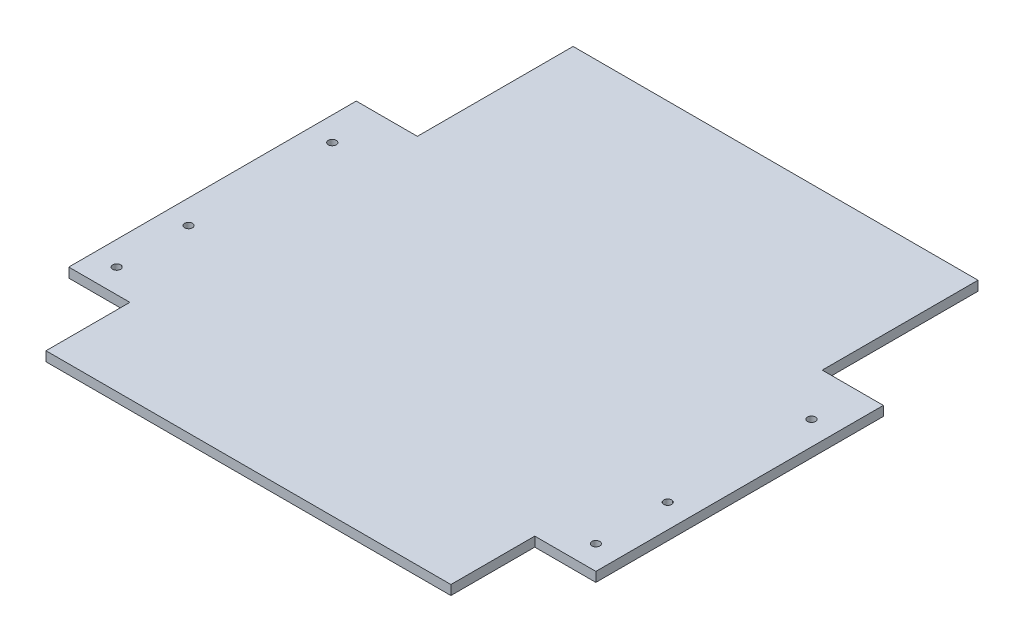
ISO-10303-21;
HEADER;
FILE_DESCRIPTION(('STEP AP214'),'2;1');
FILE_NAME('part.step','',(''),(''),'','','');
FILE_SCHEMA(('AUTOMOTIVE_DESIGN { 1 0 10303 214 1 1 1 1 }'));
ENDSEC;
DATA;
#1=APPLICATION_CONTEXT('core data for automotive mechanical design processes');
#2=APPLICATION_PROTOCOL_DEFINITION('international standard','automotive_design',2000,#1);
#3=PRODUCT_CONTEXT('',#1,'mechanical');
#4=PRODUCT('Part','Part','',(#3));
#5=PRODUCT_RELATED_PRODUCT_CATEGORY('part','',(#4));
#6=PRODUCT_DEFINITION_FORMATION('','',#4);
#7=PRODUCT_DEFINITION_CONTEXT('part definition',#1,'design');
#8=PRODUCT_DEFINITION('design','',#6,#7);
#9=PRODUCT_DEFINITION_SHAPE('','',#8);
#10=(LENGTH_UNIT() NAMED_UNIT(*) SI_UNIT(.MILLI.,.METRE.));
#11=(NAMED_UNIT(*) PLANE_ANGLE_UNIT() SI_UNIT($,.RADIAN.));
#12=(NAMED_UNIT(*) SI_UNIT($,.STERADIAN.) SOLID_ANGLE_UNIT());
#13=UNCERTAINTY_MEASURE_WITH_UNIT(LENGTH_MEASURE(1.E-05),#10,'distance_accuracy_value','');
#14=(GEOMETRIC_REPRESENTATION_CONTEXT(3) GLOBAL_UNCERTAINTY_ASSIGNED_CONTEXT((#13)) GLOBAL_UNIT_ASSIGNED_CONTEXT((#10,
#11,#12)) REPRESENTATION_CONTEXT('',''));
#15=CARTESIAN_POINT('',(0.,0.,0.));
#16=DIRECTION('',(0.,0.,1.));
#17=DIRECTION('',(1.,0.,0.));
#18=AXIS2_PLACEMENT_3D('',#15,#16,#17);
#19=CARTESIAN_POINT('',(84.5,-16.,0.));
#20=DIRECTION('',(-1.,0.,0.));
#21=DIRECTION('',(0.,1.,0.));
#22=AXIS2_PLACEMENT_3D('',#19,#20,#21);
#23=PLANE('',#22);
#24=DIRECTION('',(0.,0.,-1.));
#25=VECTOR('',#24,1.);
#26=CARTESIAN_POINT('',(84.5,0.,0.));
#27=LINE('',#26,#25);
#28=CARTESIAN_POINT('',(84.5,0.,-45.));
#29=VERTEX_POINT('',#28);
#30=CARTESIAN_POINT('',(84.5,0.,-110.));
#31=VERTEX_POINT('',#30);
#32=EDGE_CURVE('E234',#29,#31,#27,.T.);
#33=ORIENTED_EDGE('',*,*,#32,.T.);
#34=DIRECTION('',(0.,-1.,0.));
#35=VECTOR('',#34,1.);
#36=CARTESIAN_POINT('',(84.5,4.,-110.));
#37=LINE('',#36,#35);
#38=CARTESIAN_POINT('',(84.5,4.,-110.));
#39=VERTEX_POINT('',#38);
#40=EDGE_CURVE('E170',#39,#31,#37,.T.);
#41=ORIENTED_EDGE('',*,*,#40,.F.);
#42=DIRECTION('',(0.,0.,1.));
#43=VECTOR('',#42,1.);
#44=CARTESIAN_POINT('',(84.5,4.,0.));
#45=LINE('',#44,#43);
#46=CARTESIAN_POINT('',(84.5,4.,-45.));
#47=VERTEX_POINT('',#46);
#48=EDGE_CURVE('E212',#39,#47,#45,.T.);
#49=ORIENTED_EDGE('',*,*,#48,.T.);
#50=DIRECTION('',(0.,1.,0.));
#51=VECTOR('',#50,1.);
#52=CARTESIAN_POINT('',(84.5,-16.,-45.));
#53=LINE('',#52,#51);
#54=EDGE_CURVE('E10',#29,#47,#53,.T.);
#55=ORIENTED_EDGE('',*,*,#54,.F.);
#56=EDGE_LOOP('',(#33,#41,#49,#55));
#57=FACE_BOUND('',#56,.T.);
#58=ADVANCED_FACE('F16',(#57),#23,.F.);
#59=CARTESIAN_POINT('',(0.,-16.,-45.));
#60=DIRECTION('',(0.,0.,-1.));
#61=DIRECTION('',(0.,-1.,0.));
#62=AXIS2_PLACEMENT_3D('',#59,#60,#61);
#63=PLANE('',#62);
#64=ORIENTED_EDGE('',*,*,#54,.T.);
#65=DIRECTION('',(-1.,0.,0.));
#66=VECTOR('',#65,1.);
#67=CARTESIAN_POINT('',(0.,4.,-45.));
#68=LINE('',#67,#66);
#69=CARTESIAN_POINT('',(110.,4.,-45.));
#70=VERTEX_POINT('',#69);
#71=EDGE_CURVE('E319',#70,#47,#68,.T.);
#72=ORIENTED_EDGE('',*,*,#71,.F.);
#73=DIRECTION('',(0.,1.,0.));
#74=VECTOR('',#73,1.);
#75=CARTESIAN_POINT('',(110.,-16.,-45.));
#76=LINE('',#75,#74);
#77=CARTESIAN_POINT('',(110.,0.,-45.));
#78=VERTEX_POINT('',#77);
#79=EDGE_CURVE('E173',#78,#70,#76,.T.);
#80=ORIENTED_EDGE('',*,*,#79,.F.);
#81=DIRECTION('',(1.,0.,0.));
#82=VECTOR('',#81,1.);
#83=CARTESIAN_POINT('',(0.,0.,-45.));
#84=LINE('',#83,#82);
#85=EDGE_CURVE('E238',#29,#78,#84,.T.);
#86=ORIENTED_EDGE('',*,*,#85,.F.);
#87=EDGE_LOOP('',(#64,#72,#80,#86));
#88=FACE_BOUND('',#87,.T.);
#89=ADVANCED_FACE('F335',(#88),#63,.T.);
#90=CARTESIAN_POINT('',(0.,-16.,-45.));
#91=DIRECTION('',(0.,0.,1.));
#92=DIRECTION('',(1.,0.,0.));
#93=AXIS2_PLACEMENT_3D('',#90,#91,#92);
#94=PLANE('',#93);
#95=DIRECTION('',(-1.,0.,0.));
#96=VECTOR('',#95,1.);
#97=CARTESIAN_POINT('',(0.,0.,-45.));
#98=LINE('',#97,#96);
#99=CARTESIAN_POINT('',(-84.5,0.,-45.));
#100=VERTEX_POINT('',#99);
#101=CARTESIAN_POINT('',(-110.,0.,-45.));
#102=VERTEX_POINT('',#101);
#103=EDGE_CURVE('E143',#100,#102,#98,.T.);
#104=ORIENTED_EDGE('',*,*,#103,.T.);
#105=DIRECTION('',(0.,-1.,0.));
#106=VECTOR('',#105,1.);
#107=CARTESIAN_POINT('',(-110.,4.,-45.));
#108=LINE('',#107,#106);
#109=CARTESIAN_POINT('',(-110.,4.,-45.));
#110=VERTEX_POINT('',#109);
#111=EDGE_CURVE('E127',#110,#102,#108,.T.);
#112=ORIENTED_EDGE('',*,*,#111,.F.);
#113=DIRECTION('',(1.,0.,0.));
#114=VECTOR('',#113,1.);
#115=CARTESIAN_POINT('',(0.,4.,-45.));
#116=LINE('',#115,#114);
#117=CARTESIAN_POINT('',(-84.5,4.,-45.));
#118=VERTEX_POINT('',#117);
#119=EDGE_CURVE('E198',#110,#118,#116,.T.);
#120=ORIENTED_EDGE('',*,*,#119,.T.);
#121=DIRECTION('',(0.,1.,0.));
#122=VECTOR('',#121,1.);
#123=CARTESIAN_POINT('',(-84.5,-16.,-45.));
#124=LINE('',#123,#122);
#125=EDGE_CURVE('E25',#100,#118,#124,.T.);
#126=ORIENTED_EDGE('',*,*,#125,.F.);
#127=EDGE_LOOP('',(#104,#112,#120,#126));
#128=FACE_BOUND('',#127,.T.);
#129=ADVANCED_FACE('F144',(#128),#94,.F.);
#130=CARTESIAN_POINT('',(-84.5,-16.,0.));
#131=DIRECTION('',(-1.,0.,0.));
#132=DIRECTION('',(0.,0.,1.));
#133=AXIS2_PLACEMENT_3D('',#130,#131,#132);
#134=PLANE('',#133);
#135=ORIENTED_EDGE('',*,*,#125,.T.);
#136=DIRECTION('',(0.,0.,1.));
#137=VECTOR('',#136,1.);
#138=CARTESIAN_POINT('',(-84.5,4.,0.));
#139=LINE('',#138,#137);
#140=CARTESIAN_POINT('',(-84.5,4.,-110.));
#141=VERTEX_POINT('',#140);
#142=EDGE_CURVE('E196',#141,#118,#139,.T.);
#143=ORIENTED_EDGE('',*,*,#142,.F.);
#144=DIRECTION('',(0.,1.,0.));
#145=VECTOR('',#144,1.);
#146=CARTESIAN_POINT('',(-84.5,-16.,-110.));
#147=LINE('',#146,#145);
#148=CARTESIAN_POINT('',(-84.5,0.,-110.));
#149=VERTEX_POINT('',#148);
#150=EDGE_CURVE('E38',#149,#141,#147,.T.);
#151=ORIENTED_EDGE('',*,*,#150,.F.);
#152=DIRECTION('',(0.,0.,-1.));
#153=VECTOR('',#152,1.);
#154=CARTESIAN_POINT('',(-84.5,0.,0.));
#155=LINE('',#154,#153);
#156=EDGE_CURVE('E148',#100,#149,#155,.T.);
#157=ORIENTED_EDGE('',*,*,#156,.F.);
#158=EDGE_LOOP('',(#135,#143,#151,#157));
#159=FACE_BOUND('',#158,.T.);
#160=ADVANCED_FACE('F194',(#159),#134,.T.);
#161=CARTESIAN_POINT('',(-84.5,-16.,0.));
#162=DIRECTION('',(1.,0.,0.));
#163=DIRECTION('',(0.,0.,-1.));
#164=AXIS2_PLACEMENT_3D('',#161,#162,#163);
#165=PLANE('',#164);
#166=DIRECTION('',(0.,0.,1.));
#167=VECTOR('',#166,1.);
#168=CARTESIAN_POINT('',(-84.5,0.,0.));
#169=LINE('',#168,#167);
#170=CARTESIAN_POINT('',(-84.5,0.,75.));
#171=VERTEX_POINT('',#170);
#172=CARTESIAN_POINT('',(-84.5,0.,110.));
#173=VERTEX_POINT('',#172);
#174=EDGE_CURVE('E161',#171,#173,#169,.T.);
#175=ORIENTED_EDGE('',*,*,#174,.T.);
#176=DIRECTION('',(0.,-1.,0.));
#177=VECTOR('',#176,1.);
#178=CARTESIAN_POINT('',(-84.5,4.,110.));
#179=LINE('',#178,#177);
#180=CARTESIAN_POINT('',(-84.5,4.,110.));
#181=VERTEX_POINT('',#180);
#182=EDGE_CURVE('E139',#181,#173,#179,.T.);
#183=ORIENTED_EDGE('',*,*,#182,.F.);
#184=DIRECTION('',(0.,0.,-1.));
#185=VECTOR('',#184,1.);
#186=CARTESIAN_POINT('',(-84.5,4.,0.));
#187=LINE('',#186,#185);
#188=CARTESIAN_POINT('',(-84.5,4.,75.));
#189=VERTEX_POINT('',#188);
#190=EDGE_CURVE('E221',#181,#189,#187,.T.);
#191=ORIENTED_EDGE('',*,*,#190,.T.);
#192=DIRECTION('',(0.,1.,0.));
#193=VECTOR('',#192,1.);
#194=CARTESIAN_POINT('',(-84.5,-16.,75.));
#195=LINE('',#194,#193);
#196=EDGE_CURVE('E189',#171,#189,#195,.T.);
#197=ORIENTED_EDGE('',*,*,#196,.F.);
#198=EDGE_LOOP('',(#175,#183,#191,#197));
#199=FACE_BOUND('',#198,.T.);
#200=ADVANCED_FACE('F364',(#199),#165,.F.);
#201=CARTESIAN_POINT('',(0.,-16.,75.));
#202=DIRECTION('',(0.,0.,1.));
#203=DIRECTION('',(1.,0.,0.));
#204=AXIS2_PLACEMENT_3D('',#201,#202,#203);
#205=PLANE('',#204);
#206=ORIENTED_EDGE('',*,*,#196,.T.);
#207=DIRECTION('',(1.,0.,0.));
#208=VECTOR('',#207,1.);
#209=CARTESIAN_POINT('',(0.,4.,75.));
#210=LINE('',#209,#208);
#211=CARTESIAN_POINT('',(-110.,4.,75.));
#212=VERTEX_POINT('',#211);
#213=EDGE_CURVE('E220',#212,#189,#210,.T.);
#214=ORIENTED_EDGE('',*,*,#213,.F.);
#215=DIRECTION('',(0.,1.,0.));
#216=VECTOR('',#215,1.);
#217=CARTESIAN_POINT('',(-110.,-16.,75.));
#218=LINE('',#217,#216);
#219=CARTESIAN_POINT('',(-110.,0.,75.));
#220=VERTEX_POINT('',#219);
#221=EDGE_CURVE('E140',#220,#212,#218,.T.);
#222=ORIENTED_EDGE('',*,*,#221,.F.);
#223=DIRECTION('',(-1.,0.,0.));
#224=VECTOR('',#223,1.);
#225=CARTESIAN_POINT('',(0.,0.,75.));
#226=LINE('',#225,#224);
#227=EDGE_CURVE('E154',#171,#220,#226,.T.);
#228=ORIENTED_EDGE('',*,*,#227,.F.);
#229=EDGE_LOOP('',(#206,#214,#222,#228));
#230=FACE_BOUND('',#229,.T.);
#231=ADVANCED_FACE('F367',(#230),#205,.T.);
#232=CARTESIAN_POINT('',(0.,-16.,75.));
#233=DIRECTION('',(0.,0.,-1.));
#234=DIRECTION('',(0.,-1.,0.));
#235=AXIS2_PLACEMENT_3D('',#232,#233,#234);
#236=PLANE('',#235);
#237=DIRECTION('',(1.,0.,0.));
#238=VECTOR('',#237,1.);
#239=CARTESIAN_POINT('',(0.,0.,75.));
#240=LINE('',#239,#238);
#241=CARTESIAN_POINT('',(84.5,0.,75.));
#242=VERTEX_POINT('',#241);
#243=CARTESIAN_POINT('',(110.,0.,75.));
#244=VERTEX_POINT('',#243);
#245=EDGE_CURVE('E243',#242,#244,#240,.T.);
#246=ORIENTED_EDGE('',*,*,#245,.T.);
#247=DIRECTION('',(0.,1.,0.));
#248=VECTOR('',#247,1.);
#249=CARTESIAN_POINT('',(110.,-16.,75.));
#250=LINE('',#249,#248);
#251=CARTESIAN_POINT('',(110.,4.,75.));
#252=VERTEX_POINT('',#251);
#253=EDGE_CURVE('E176',#244,#252,#250,.T.);
#254=ORIENTED_EDGE('',*,*,#253,.T.);
#255=DIRECTION('',(-1.,0.,0.));
#256=VECTOR('',#255,1.);
#257=CARTESIAN_POINT('',(0.,4.,75.));
#258=LINE('',#257,#256);
#259=CARTESIAN_POINT('',(84.5,4.,75.));
#260=VERTEX_POINT('',#259);
#261=EDGE_CURVE('E230',#252,#260,#258,.T.);
#262=ORIENTED_EDGE('',*,*,#261,.T.);
#263=DIRECTION('',(0.,1.,0.));
#264=VECTOR('',#263,1.);
#265=CARTESIAN_POINT('',(84.5,-16.,75.));
#266=LINE('',#265,#264);
#267=EDGE_CURVE('E186',#242,#260,#266,.T.);
#268=ORIENTED_EDGE('',*,*,#267,.F.);
#269=EDGE_LOOP('',(#246,#254,#262,#268));
#270=FACE_BOUND('',#269,.T.);
#271=ADVANCED_FACE('F370',(#270),#236,.F.);
#272=CARTESIAN_POINT('',(84.5,-16.,0.));
#273=DIRECTION('',(1.,0.,0.));
#274=DIRECTION('',(0.,1.,0.));
#275=AXIS2_PLACEMENT_3D('',#272,#273,#274);
#276=PLANE('',#275);
#277=ORIENTED_EDGE('',*,*,#267,.T.);
#278=DIRECTION('',(0.,0.,-1.));
#279=VECTOR('',#278,1.);
#280=CARTESIAN_POINT('',(84.5,4.,0.));
#281=LINE('',#280,#279);
#282=CARTESIAN_POINT('',(84.5,4.,110.));
#283=VERTEX_POINT('',#282);
#284=EDGE_CURVE('E229',#283,#260,#281,.T.);
#285=ORIENTED_EDGE('',*,*,#284,.F.);
#286=DIRECTION('',(0.,-1.,0.));
#287=VECTOR('',#286,1.);
#288=CARTESIAN_POINT('',(84.5,4.,110.));
#289=LINE('',#288,#287);
#290=CARTESIAN_POINT('',(84.5,0.,110.));
#291=VERTEX_POINT('',#290);
#292=EDGE_CURVE('E185',#283,#291,#289,.T.);
#293=ORIENTED_EDGE('',*,*,#292,.T.);
#294=DIRECTION('',(0.,0.,1.));
#295=VECTOR('',#294,1.);
#296=CARTESIAN_POINT('',(84.5,0.,0.));
#297=LINE('',#296,#295);
#298=EDGE_CURVE('E246',#242,#291,#297,.T.);
#299=ORIENTED_EDGE('',*,*,#298,.F.);
#300=EDGE_LOOP('',(#277,#285,#293,#299));
#301=FACE_BOUND('',#300,.T.);
#302=ADVANCED_FACE('F373',(#301),#276,.T.);
#303=CARTESIAN_POINT('',(-110.,4.,110.));
#304=DIRECTION('',(0.,0.,-1.));
#305=DIRECTION('',(0.,-1.,0.));
#306=AXIS2_PLACEMENT_3D('',#303,#304,#305);
#307=PLANE('',#306);
#308=DIRECTION('',(1.,0.,0.));
#309=VECTOR('',#308,1.);
#310=CARTESIAN_POINT('',(-110.,4.,110.));
#311=LINE('',#310,#309);
#312=EDGE_CURVE('E225',#181,#283,#311,.T.);
#313=ORIENTED_EDGE('',*,*,#312,.F.);
#314=ORIENTED_EDGE('',*,*,#182,.T.);
#315=DIRECTION('',(1.,0.,0.));
#316=VECTOR('',#315,1.);
#317=CARTESIAN_POINT('',(-110.,0.,110.));
#318=LINE('',#317,#316);
#319=EDGE_CURVE('E249',#173,#291,#318,.T.);
#320=ORIENTED_EDGE('',*,*,#319,.T.);
#321=ORIENTED_EDGE('',*,*,#292,.F.);
#322=EDGE_LOOP('',(#313,#314,#320,#321));
#323=FACE_BOUND('',#322,.T.);
#324=ADVANCED_FACE('F350',(#323),#307,.F.);
#325=CARTESIAN_POINT('',(-110.,4.,110.));
#326=DIRECTION('',(1.,0.,0.));
#327=DIRECTION('',(0.,1.,0.));
#328=AXIS2_PLACEMENT_3D('',#325,#326,#327);
#329=PLANE('',#328);
#330=ORIENTED_EDGE('',*,*,#221,.T.);
#331=DIRECTION('',(0.,0.,1.));
#332=VECTOR('',#331,1.);
#333=CARTESIAN_POINT('',(-110.,4.,110.));
#334=LINE('',#333,#332);
#335=EDGE_CURVE('E134',#110,#212,#334,.T.);
#336=ORIENTED_EDGE('',*,*,#335,.F.);
#337=ORIENTED_EDGE('',*,*,#111,.T.);
#338=DIRECTION('',(0.,0.,1.));
#339=VECTOR('',#338,1.);
#340=CARTESIAN_POINT('',(-110.,0.,110.));
#341=LINE('',#340,#339);
#342=EDGE_CURVE('E131',#102,#220,#341,.T.);
#343=ORIENTED_EDGE('',*,*,#342,.T.);
#344=EDGE_LOOP('',(#330,#336,#337,#343));
#345=FACE_BOUND('',#344,.T.);
#346=ADVANCED_FACE('F129',(#345),#329,.F.);
#347=CARTESIAN_POINT('',(-110.,4.,-110.));
#348=DIRECTION('',(0.,0.,1.));
#349=DIRECTION('',(1.,0.,0.));
#350=AXIS2_PLACEMENT_3D('',#347,#348,#349);
#351=PLANE('',#350);
#352=DIRECTION('',(-1.,0.,0.));
#353=VECTOR('',#352,1.);
#354=CARTESIAN_POINT('',(-110.,4.,-110.));
#355=LINE('',#354,#353);
#356=EDGE_CURVE('E206',#39,#141,#355,.T.);
#357=ORIENTED_EDGE('',*,*,#356,.F.);
#358=ORIENTED_EDGE('',*,*,#40,.T.);
#359=DIRECTION('',(-1.,0.,0.));
#360=VECTOR('',#359,1.);
#361=CARTESIAN_POINT('',(-110.,0.,-110.));
#362=LINE('',#361,#360);
#363=EDGE_CURVE('E167',#31,#149,#362,.T.);
#364=ORIENTED_EDGE('',*,*,#363,.T.);
#365=ORIENTED_EDGE('',*,*,#150,.T.);
#366=EDGE_LOOP('',(#357,#358,#364,#365));
#367=FACE_BOUND('',#366,.T.);
#368=ADVANCED_FACE('F339',(#367),#351,.F.);
#369=CARTESIAN_POINT('',(110.,4.,110.));
#370=DIRECTION('',(-1.,0.,0.));
#371=DIRECTION('',(0.,0.,1.));
#372=AXIS2_PLACEMENT_3D('',#369,#370,#371);
#373=PLANE('',#372);
#374=ORIENTED_EDGE('',*,*,#79,.T.);
#375=DIRECTION('',(0.,0.,-1.));
#376=VECTOR('',#375,1.);
#377=CARTESIAN_POINT('',(110.,4.,110.));
#378=LINE('',#377,#376);
#379=EDGE_CURVE('E215',#252,#70,#378,.T.);
#380=ORIENTED_EDGE('',*,*,#379,.F.);
#381=ORIENTED_EDGE('',*,*,#253,.F.);
#382=DIRECTION('',(0.,0.,-1.));
#383=VECTOR('',#382,1.);
#384=CARTESIAN_POINT('',(110.,0.,110.));
#385=LINE('',#384,#383);
#386=EDGE_CURVE('E239',#244,#78,#385,.T.);
#387=ORIENTED_EDGE('',*,*,#386,.T.);
#388=EDGE_LOOP('',(#374,#380,#381,#387));
#389=FACE_BOUND('',#388,.T.);
#390=ADVANCED_FACE('F341',(#389),#373,.F.);
#391=CARTESIAN_POINT('',(0.,0.,0.));
#392=DIRECTION('',(0.,-1.,0.));
#393=DIRECTION('',(0.,0.,-1.));
#394=AXIS2_PLACEMENT_3D('',#391,#392,#393);
#395=PLANE('',#394);
#396=CARTESIAN_POINT('',(-100.,0.,35.));
#397=DIRECTION('',(0.,1.,0.));
#398=DIRECTION('',(0.,0.,1.));
#399=AXIS2_PLACEMENT_3D('',#396,#397,#398);
#400=CIRCLE('',#399,1.65);
#401=CARTESIAN_POINT('',(-100.,0.,36.65));
#402=VERTEX_POINT('',#401);
#403=EDGE_CURVE('E270',#402,#402,#400,.T.);
#404=ORIENTED_EDGE('',*,*,#403,.T.);
#405=EDGE_LOOP('',(#404));
#406=FACE_BOUND('',#405,.T.);
#407=CARTESIAN_POINT('',(100.,0.,-25.));
#408=DIRECTION('',(0.,1.,0.));
#409=DIRECTION('',(0.,0.,1.));
#410=AXIS2_PLACEMENT_3D('',#407,#408,#409);
#411=CIRCLE('',#410,1.65);
#412=CARTESIAN_POINT('',(100.,0.,-23.35));
#413=VERTEX_POINT('',#412);
#414=EDGE_CURVE('E275',#413,#413,#411,.T.);
#415=ORIENTED_EDGE('',*,*,#414,.T.);
#416=EDGE_LOOP('',(#415));
#417=FACE_BOUND('',#416,.T.);
#418=CARTESIAN_POINT('',(-100.,0.,65.));
#419=DIRECTION('',(0.,1.,0.));
#420=DIRECTION('',(0.,0.,1.));
#421=AXIS2_PLACEMENT_3D('',#418,#419,#420);
#422=CIRCLE('',#421,1.65);
#423=CARTESIAN_POINT('',(-100.,0.,66.65));
#424=VERTEX_POINT('',#423);
#425=EDGE_CURVE('E277',#424,#424,#422,.T.);
#426=ORIENTED_EDGE('',*,*,#425,.T.);
#427=EDGE_LOOP('',(#426));
#428=FACE_BOUND('',#427,.T.);
#429=CARTESIAN_POINT('',(-100.,0.,-25.));
#430=DIRECTION('',(0.,1.,0.));
#431=DIRECTION('',(0.,0.,1.));
#432=AXIS2_PLACEMENT_3D('',#429,#430,#431);
#433=CIRCLE('',#432,1.65);
#434=CARTESIAN_POINT('',(-100.,0.,-23.35));
#435=VERTEX_POINT('',#434);
#436=EDGE_CURVE('E312',#435,#435,#433,.T.);
#437=ORIENTED_EDGE('',*,*,#436,.T.);
#438=EDGE_LOOP('',(#437));
#439=FACE_BOUND('',#438,.T.);
#440=CARTESIAN_POINT('',(100.,0.,65.));
#441=DIRECTION('',(0.,1.,0.));
#442=DIRECTION('',(0.,0.,1.));
#443=AXIS2_PLACEMENT_3D('',#440,#441,#442);
#444=CIRCLE('',#443,1.65);
#445=CARTESIAN_POINT('',(100.,0.,66.65));
#446=VERTEX_POINT('',#445);
#447=EDGE_CURVE('E274',#446,#446,#444,.T.);
#448=ORIENTED_EDGE('',*,*,#447,.T.);
#449=EDGE_LOOP('',(#448));
#450=FACE_BOUND('',#449,.T.);
#451=CARTESIAN_POINT('',(100.,0.,35.));
#452=DIRECTION('',(0.,1.,0.));
#453=DIRECTION('',(0.,0.,1.));
#454=AXIS2_PLACEMENT_3D('',#451,#452,#453);
#455=CIRCLE('',#454,1.65);
#456=CARTESIAN_POINT('',(100.,0.,36.65));
#457=VERTEX_POINT('',#456);
#458=EDGE_CURVE('E265',#457,#457,#455,.T.);
#459=ORIENTED_EDGE('',*,*,#458,.T.);
#460=EDGE_LOOP('',(#459));
#461=FACE_BOUND('',#460,.T.);
#462=ORIENTED_EDGE('',*,*,#32,.F.);
#463=ORIENTED_EDGE('',*,*,#85,.T.);
#464=ORIENTED_EDGE('',*,*,#386,.F.);
#465=ORIENTED_EDGE('',*,*,#245,.F.);
#466=ORIENTED_EDGE('',*,*,#298,.T.);
#467=ORIENTED_EDGE('',*,*,#319,.F.);
#468=ORIENTED_EDGE('',*,*,#174,.F.);
#469=ORIENTED_EDGE('',*,*,#227,.T.);
#470=ORIENTED_EDGE('',*,*,#342,.F.);
#471=ORIENTED_EDGE('',*,*,#103,.F.);
#472=ORIENTED_EDGE('',*,*,#156,.T.);
#473=ORIENTED_EDGE('',*,*,#363,.F.);
#474=EDGE_LOOP('',(#462,#463,#464,#465,#466,#467,#468,#469,#470,#471,#472,#473));
#475=FACE_BOUND('',#474,.T.);
#476=ADVANCED_FACE('F151',(#406,#417,#428,#439,#450,#461,#475),#395,.T.);
#477=CARTESIAN_POINT('',(0.,4.,0.));
#478=DIRECTION('',(0.,-1.,0.));
#479=DIRECTION('',(0.,0.,-1.));
#480=AXIS2_PLACEMENT_3D('',#477,#478,#479);
#481=PLANE('',#480);
#482=CARTESIAN_POINT('',(-100.,4.,35.));
#483=DIRECTION('',(0.,1.,0.));
#484=DIRECTION('',(0.,0.,1.));
#485=AXIS2_PLACEMENT_3D('',#482,#483,#484);
#486=CIRCLE('',#485,1.65);
#487=CARTESIAN_POINT('',(-100.,4.,36.65));
#488=VERTEX_POINT('',#487);
#489=EDGE_CURVE('E266',#488,#488,#486,.T.);
#490=ORIENTED_EDGE('',*,*,#489,.F.);
#491=EDGE_LOOP('',(#490));
#492=FACE_BOUND('',#491,.T.);
#493=CARTESIAN_POINT('',(100.,4.,35.));
#494=DIRECTION('',(0.,1.,0.));
#495=DIRECTION('',(0.,0.,1.));
#496=AXIS2_PLACEMENT_3D('',#493,#494,#495);
#497=CIRCLE('',#496,1.65);
#498=CARTESIAN_POINT('',(100.,4.,36.65));
#499=VERTEX_POINT('',#498);
#500=EDGE_CURVE('E285',#499,#499,#497,.T.);
#501=ORIENTED_EDGE('',*,*,#500,.F.);
#502=EDGE_LOOP('',(#501));
#503=FACE_BOUND('',#502,.T.);
#504=CARTESIAN_POINT('',(100.,4.,-25.));
#505=DIRECTION('',(0.,1.,0.));
#506=DIRECTION('',(0.,0.,1.));
#507=AXIS2_PLACEMENT_3D('',#504,#505,#506);
#508=CIRCLE('',#507,1.65);
#509=CARTESIAN_POINT('',(100.,4.,-23.35));
#510=VERTEX_POINT('',#509);
#511=EDGE_CURVE('E293',#510,#510,#508,.T.);
#512=ORIENTED_EDGE('',*,*,#511,.F.);
#513=EDGE_LOOP('',(#512));
#514=FACE_BOUND('',#513,.T.);
#515=CARTESIAN_POINT('',(100.,4.,65.));
#516=DIRECTION('',(0.,1.,0.));
#517=DIRECTION('',(0.,0.,1.));
#518=AXIS2_PLACEMENT_3D('',#515,#516,#517);
#519=CIRCLE('',#518,1.65);
#520=CARTESIAN_POINT('',(100.,4.,66.65));
#521=VERTEX_POINT('',#520);
#522=EDGE_CURVE('E271',#521,#521,#519,.T.);
#523=ORIENTED_EDGE('',*,*,#522,.F.);
#524=EDGE_LOOP('',(#523));
#525=FACE_BOUND('',#524,.T.);
#526=CARTESIAN_POINT('',(-100.,4.,65.));
#527=DIRECTION('',(0.,1.,0.));
#528=DIRECTION('',(0.,0.,1.));
#529=AXIS2_PLACEMENT_3D('',#526,#527,#528);
#530=CIRCLE('',#529,1.65);
#531=CARTESIAN_POINT('',(-100.,4.,66.65));
#532=VERTEX_POINT('',#531);
#533=EDGE_CURVE('E282',#532,#532,#530,.T.);
#534=ORIENTED_EDGE('',*,*,#533,.F.);
#535=EDGE_LOOP('',(#534));
#536=FACE_BOUND('',#535,.T.);
#537=CARTESIAN_POINT('',(-100.,4.,-25.));
#538=DIRECTION('',(0.,1.,0.));
#539=DIRECTION('',(0.,0.,1.));
#540=AXIS2_PLACEMENT_3D('',#537,#538,#539);
#541=CIRCLE('',#540,1.65);
#542=CARTESIAN_POINT('',(-100.,4.,-23.35));
#543=VERTEX_POINT('',#542);
#544=EDGE_CURVE('E281',#543,#543,#541,.T.);
#545=ORIENTED_EDGE('',*,*,#544,.F.);
#546=EDGE_LOOP('',(#545));
#547=FACE_BOUND('',#546,.T.);
#548=ORIENTED_EDGE('',*,*,#71,.T.);
#549=ORIENTED_EDGE('',*,*,#48,.F.);
#550=ORIENTED_EDGE('',*,*,#356,.T.);
#551=ORIENTED_EDGE('',*,*,#142,.T.);
#552=ORIENTED_EDGE('',*,*,#119,.F.);
#553=ORIENTED_EDGE('',*,*,#335,.T.);
#554=ORIENTED_EDGE('',*,*,#213,.T.);
#555=ORIENTED_EDGE('',*,*,#190,.F.);
#556=ORIENTED_EDGE('',*,*,#312,.T.);
#557=ORIENTED_EDGE('',*,*,#284,.T.);
#558=ORIENTED_EDGE('',*,*,#261,.F.);
#559=ORIENTED_EDGE('',*,*,#379,.T.);
#560=EDGE_LOOP('',(#548,#549,#550,#551,#552,#553,#554,#555,#556,#557,#558,#559));
#561=FACE_BOUND('',#560,.T.);
#562=ADVANCED_FACE('F203',(#492,#503,#514,#525,#536,#547,#561),#481,.F.);
#563=CARTESIAN_POINT('',(-100.,4.,-25.));
#564=DIRECTION('',(0.,-1.,0.));
#565=DIRECTION('',(0.,0.,-1.));
#566=AXIS2_PLACEMENT_3D('',#563,#564,#565);
#567=CYLINDRICAL_SURFACE('',#566,1.65);
#568=ORIENTED_EDGE('',*,*,#436,.F.);
#569=EDGE_LOOP('',(#568));
#570=FACE_BOUND('',#569,.T.);
#571=ORIENTED_EDGE('',*,*,#544,.T.);
#572=EDGE_LOOP('',(#571));
#573=FACE_BOUND('',#572,.T.);
#574=ADVANCED_FACE('F486',(#570,#573),#567,.F.);
#575=CARTESIAN_POINT('',(-100.,4.,65.));
#576=DIRECTION('',(0.,-1.,0.));
#577=DIRECTION('',(0.,0.,-1.));
#578=AXIS2_PLACEMENT_3D('',#575,#576,#577);
#579=CYLINDRICAL_SURFACE('',#578,1.65);
#580=ORIENTED_EDGE('',*,*,#425,.F.);
#581=EDGE_LOOP('',(#580));
#582=FACE_BOUND('',#581,.T.);
#583=ORIENTED_EDGE('',*,*,#533,.T.);
#584=EDGE_LOOP('',(#583));
#585=FACE_BOUND('',#584,.T.);
#586=ADVANCED_FACE('F492',(#582,#585),#579,.F.);
#587=CARTESIAN_POINT('',(100.,4.,65.));
#588=DIRECTION('',(0.,-1.,0.));
#589=DIRECTION('',(0.,0.,-1.));
#590=AXIS2_PLACEMENT_3D('',#587,#588,#589);
#591=CYLINDRICAL_SURFACE('',#590,1.65);
#592=ORIENTED_EDGE('',*,*,#447,.F.);
#593=EDGE_LOOP('',(#592));
#594=FACE_BOUND('',#593,.T.);
#595=ORIENTED_EDGE('',*,*,#522,.T.);
#596=EDGE_LOOP('',(#595));
#597=FACE_BOUND('',#596,.T.);
#598=ADVANCED_FACE('F507',(#594,#597),#591,.F.);
#599=CARTESIAN_POINT('',(100.,4.,-25.));
#600=DIRECTION('',(0.,-1.,0.));
#601=DIRECTION('',(0.,0.,-1.));
#602=AXIS2_PLACEMENT_3D('',#599,#600,#601);
#603=CYLINDRICAL_SURFACE('',#602,1.65);
#604=ORIENTED_EDGE('',*,*,#414,.F.);
#605=EDGE_LOOP('',(#604));
#606=FACE_BOUND('',#605,.T.);
#607=ORIENTED_EDGE('',*,*,#511,.T.);
#608=EDGE_LOOP('',(#607));
#609=FACE_BOUND('',#608,.T.);
#610=ADVANCED_FACE('F519',(#606,#609),#603,.F.);
#611=CARTESIAN_POINT('',(100.,4.,35.));
#612=DIRECTION('',(0.,-1.,0.));
#613=DIRECTION('',(0.,0.,-1.));
#614=AXIS2_PLACEMENT_3D('',#611,#612,#613);
#615=CYLINDRICAL_SURFACE('',#614,1.65);
#616=ORIENTED_EDGE('',*,*,#458,.F.);
#617=EDGE_LOOP('',(#616));
#618=FACE_BOUND('',#617,.T.);
#619=ORIENTED_EDGE('',*,*,#500,.T.);
#620=EDGE_LOOP('',(#619));
#621=FACE_BOUND('',#620,.T.);
#622=ADVANCED_FACE('F531',(#618,#621),#615,.F.);
#623=CARTESIAN_POINT('',(-100.,4.,35.));
#624=DIRECTION('',(0.,-1.,0.));
#625=DIRECTION('',(0.,0.,-1.));
#626=AXIS2_PLACEMENT_3D('',#623,#624,#625);
#627=CYLINDRICAL_SURFACE('',#626,1.65);
#628=ORIENTED_EDGE('',*,*,#403,.F.);
#629=EDGE_LOOP('',(#628));
#630=FACE_BOUND('',#629,.T.);
#631=ORIENTED_EDGE('',*,*,#489,.T.);
#632=EDGE_LOOP('',(#631));
#633=FACE_BOUND('',#632,.T.);
#634=ADVANCED_FACE('F543',(#630,#633),#627,.F.);
#635=CLOSED_SHELL('',(#58,#89,#129,#160,#200,#231,#271,#302,#324,#346,#368,#390,#476,#562,#574,
#586,#598,#610,#622,#634));
#636=MANIFOLD_SOLID_BREP('B1',#635);
#637=ADVANCED_BREP_SHAPE_REPRESENTATION('',(#18,#636),#14);
#638=SHAPE_DEFINITION_REPRESENTATION(#9,#637);
ENDSEC;
END-ISO-10303-21;
